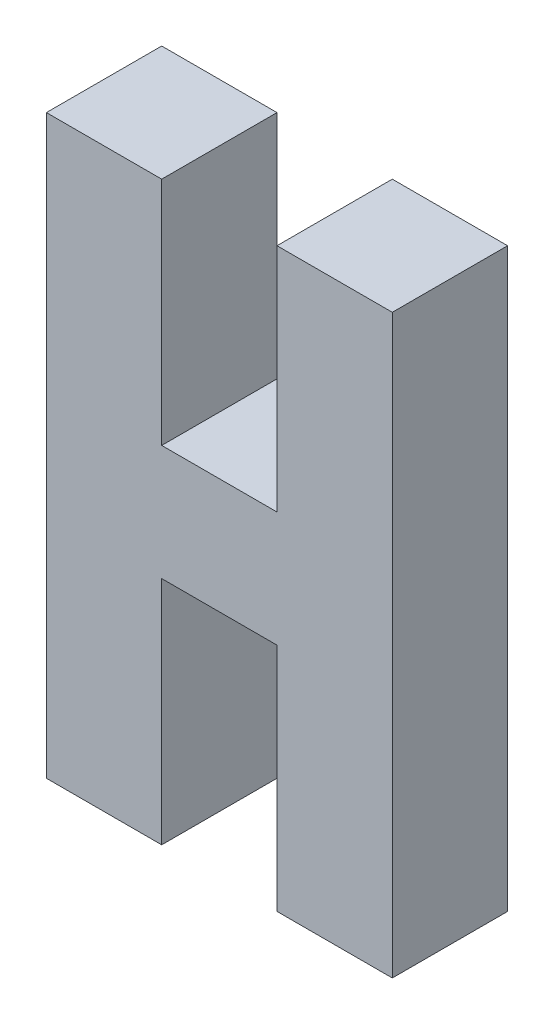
ISO-10303-21;
HEADER;
FILE_DESCRIPTION(('STEP AP214'),'2;1');
FILE_NAME('part.step','',(''),(''),'','','');
FILE_SCHEMA(('AUTOMOTIVE_DESIGN { 1 0 10303 214 1 1 1 1 }'));
ENDSEC;
DATA;
#1=APPLICATION_CONTEXT('core data for automotive mechanical design processes');
#2=APPLICATION_PROTOCOL_DEFINITION('international standard','automotive_design',2000,#1);
#3=PRODUCT_CONTEXT('',#1,'mechanical');
#4=PRODUCT('Part','Part','',(#3));
#5=PRODUCT_RELATED_PRODUCT_CATEGORY('part','',(#4));
#6=PRODUCT_DEFINITION_FORMATION('','',#4);
#7=PRODUCT_DEFINITION_CONTEXT('part definition',#1,'design');
#8=PRODUCT_DEFINITION('design','',#6,#7);
#9=PRODUCT_DEFINITION_SHAPE('','',#8);
#10=(LENGTH_UNIT() NAMED_UNIT(*) SI_UNIT(.MILLI.,.METRE.));
#11=(NAMED_UNIT(*) PLANE_ANGLE_UNIT() SI_UNIT($,.RADIAN.));
#12=(NAMED_UNIT(*) SI_UNIT($,.STERADIAN.) SOLID_ANGLE_UNIT());
#13=UNCERTAINTY_MEASURE_WITH_UNIT(LENGTH_MEASURE(1.E-05),#10,'distance_accuracy_value','');
#14=(GEOMETRIC_REPRESENTATION_CONTEXT(3) GLOBAL_UNCERTAINTY_ASSIGNED_CONTEXT((#13)) GLOBAL_UNIT_ASSIGNED_CONTEXT((#10,
#11,#12)) REPRESENTATION_CONTEXT('',''));
#15=CARTESIAN_POINT('',(0.,0.,0.));
#16=DIRECTION('',(0.,0.,1.));
#17=DIRECTION('',(1.,0.,0.));
#18=AXIS2_PLACEMENT_3D('',#15,#16,#17);
#19=CARTESIAN_POINT('',(0.,0.,10.));
#20=DIRECTION('',(1.,0.,0.));
#21=DIRECTION('',(0.,0.,-1.));
#22=AXIS2_PLACEMENT_3D('',#19,#20,#21);
#23=PLANE('',#22);
#24=DIRECTION('',(0.,-1.,0.));
#25=VECTOR('',#24,1.);
#26=CARTESIAN_POINT('',(0.,0.,0.));
#27=LINE('',#26,#25);
#28=CARTESIAN_POINT('',(0.,50.,0.));
#29=VERTEX_POINT('',#28);
#30=CARTESIAN_POINT('',(0.,0.,0.));
#31=VERTEX_POINT('',#30);
#32=EDGE_CURVE('E153',#29,#31,#27,.T.);
#33=ORIENTED_EDGE('',*,*,#32,.T.);
#34=DIRECTION('',(0.,0.,-1.));
#35=VECTOR('',#34,1.);
#36=CARTESIAN_POINT('',(0.,0.,10.));
#37=LINE('',#36,#35);
#38=CARTESIAN_POINT('',(0.,0.,10.));
#39=VERTEX_POINT('',#38);
#40=EDGE_CURVE('E11',#39,#31,#37,.T.);
#41=ORIENTED_EDGE('',*,*,#40,.F.);
#42=DIRECTION('',(0.,-1.,0.));
#43=VECTOR('',#42,1.);
#44=CARTESIAN_POINT('',(0.,0.,10.));
#45=LINE('',#44,#43);
#46=CARTESIAN_POINT('',(0.,50.,10.));
#47=VERTEX_POINT('',#46);
#48=EDGE_CURVE('E175',#47,#39,#45,.T.);
#49=ORIENTED_EDGE('',*,*,#48,.F.);
#50=DIRECTION('',(0.,0.,-1.));
#51=VECTOR('',#50,1.);
#52=CARTESIAN_POINT('',(0.,50.,10.));
#53=LINE('',#52,#51);
#54=EDGE_CURVE('E149',#47,#29,#53,.T.);
#55=ORIENTED_EDGE('',*,*,#54,.T.);
#56=EDGE_LOOP('',(#33,#41,#49,#55));
#57=FACE_BOUND('',#56,.T.);
#58=ADVANCED_FACE('F33',(#57),#23,.F.);
#59=CARTESIAN_POINT('',(0.,0.,10.));
#60=DIRECTION('',(0.,1.,0.));
#61=DIRECTION('',(0.,0.,1.));
#62=AXIS2_PLACEMENT_3D('',#59,#60,#61);
#63=PLANE('',#62);
#64=DIRECTION('',(1.,0.,0.));
#65=VECTOR('',#64,1.);
#66=CARTESIAN_POINT('',(0.,0.,0.));
#67=LINE('',#66,#65);
#68=CARTESIAN_POINT('',(10.,0.,0.));
#69=VERTEX_POINT('',#68);
#70=EDGE_CURVE('E156',#31,#69,#67,.T.);
#71=ORIENTED_EDGE('',*,*,#70,.T.);
#72=DIRECTION('',(0.,0.,-1.));
#73=VECTOR('',#72,1.);
#74=CARTESIAN_POINT('',(10.,0.,10.));
#75=LINE('',#74,#73);
#76=CARTESIAN_POINT('',(10.,0.,10.));
#77=VERTEX_POINT('',#76);
#78=EDGE_CURVE('E41',#77,#69,#75,.T.);
#79=ORIENTED_EDGE('',*,*,#78,.F.);
#80=DIRECTION('',(1.,0.,0.));
#81=VECTOR('',#80,1.);
#82=CARTESIAN_POINT('',(0.,0.,10.));
#83=LINE('',#82,#81);
#84=EDGE_CURVE('E104',#39,#77,#83,.T.);
#85=ORIENTED_EDGE('',*,*,#84,.F.);
#86=ORIENTED_EDGE('',*,*,#40,.T.);
#87=EDGE_LOOP('',(#71,#79,#85,#86));
#88=FACE_BOUND('',#87,.T.);
#89=ADVANCED_FACE('F253',(#88),#63,.F.);
#90=CARTESIAN_POINT('',(10.,0.,10.));
#91=DIRECTION('',(-1.,0.,0.));
#92=DIRECTION('',(0.,0.,1.));
#93=AXIS2_PLACEMENT_3D('',#90,#91,#92);
#94=PLANE('',#93);
#95=DIRECTION('',(0.,1.,0.));
#96=VECTOR('',#95,1.);
#97=CARTESIAN_POINT('',(10.,0.,0.));
#98=LINE('',#97,#96);
#99=CARTESIAN_POINT('',(10.,20.,0.));
#100=VERTEX_POINT('',#99);
#101=EDGE_CURVE('E158',#69,#100,#98,.T.);
#102=ORIENTED_EDGE('',*,*,#101,.T.);
#103=DIRECTION('',(0.,0.,-1.));
#104=VECTOR('',#103,1.);
#105=CARTESIAN_POINT('',(10.,20.,10.));
#106=LINE('',#105,#104);
#107=CARTESIAN_POINT('',(10.,20.,10.));
#108=VERTEX_POINT('',#107);
#109=EDGE_CURVE('E194',#108,#100,#106,.T.);
#110=ORIENTED_EDGE('',*,*,#109,.F.);
#111=DIRECTION('',(0.,1.,0.));
#112=VECTOR('',#111,1.);
#113=CARTESIAN_POINT('',(10.,0.,10.));
#114=LINE('',#113,#112);
#115=EDGE_CURVE('E202',#77,#108,#114,.T.);
#116=ORIENTED_EDGE('',*,*,#115,.F.);
#117=ORIENTED_EDGE('',*,*,#78,.T.);
#118=EDGE_LOOP('',(#102,#110,#116,#117));
#119=FACE_BOUND('',#118,.T.);
#120=ADVANCED_FACE('F200',(#119),#94,.F.);
#121=CARTESIAN_POINT('',(10.,20.,10.));
#122=DIRECTION('',(0.,1.,0.));
#123=DIRECTION('',(0.,0.,1.));
#124=AXIS2_PLACEMENT_3D('',#121,#122,#123);
#125=PLANE('',#124);
#126=DIRECTION('',(1.,0.,0.));
#127=VECTOR('',#126,1.);
#128=CARTESIAN_POINT('',(10.,20.,0.));
#129=LINE('',#128,#127);
#130=CARTESIAN_POINT('',(20.,20.,0.));
#131=VERTEX_POINT('',#130);
#132=EDGE_CURVE('E160',#100,#131,#129,.T.);
#133=ORIENTED_EDGE('',*,*,#132,.T.);
#134=DIRECTION('',(0.,0.,-1.));
#135=VECTOR('',#134,1.);
#136=CARTESIAN_POINT('',(20.,20.,10.));
#137=LINE('',#136,#135);
#138=CARTESIAN_POINT('',(20.,20.,10.));
#139=VERTEX_POINT('',#138);
#140=EDGE_CURVE('E191',#139,#131,#137,.T.);
#141=ORIENTED_EDGE('',*,*,#140,.F.);
#142=DIRECTION('',(1.,0.,0.));
#143=VECTOR('',#142,1.);
#144=CARTESIAN_POINT('',(10.,20.,10.));
#145=LINE('',#144,#143);
#146=EDGE_CURVE('E220',#108,#139,#145,.T.);
#147=ORIENTED_EDGE('',*,*,#146,.F.);
#148=ORIENTED_EDGE('',*,*,#109,.T.);
#149=EDGE_LOOP('',(#133,#141,#147,#148));
#150=FACE_BOUND('',#149,.T.);
#151=ADVANCED_FACE('F211',(#150),#125,.F.);
#152=CARTESIAN_POINT('',(20.,0.,10.));
#153=DIRECTION('',(1.,0.,0.));
#154=DIRECTION('',(0.,0.,-1.));
#155=AXIS2_PLACEMENT_3D('',#152,#153,#154);
#156=PLANE('',#155);
#157=DIRECTION('',(0.,-1.,0.));
#158=VECTOR('',#157,1.);
#159=CARTESIAN_POINT('',(20.,0.,0.));
#160=LINE('',#159,#158);
#161=CARTESIAN_POINT('',(20.,0.,0.));
#162=VERTEX_POINT('',#161);
#163=EDGE_CURVE('E162',#131,#162,#160,.T.);
#164=ORIENTED_EDGE('',*,*,#163,.T.);
#165=DIRECTION('',(0.,0.,-1.));
#166=VECTOR('',#165,1.);
#167=CARTESIAN_POINT('',(20.,0.,10.));
#168=LINE('',#167,#166);
#169=CARTESIAN_POINT('',(20.,0.,10.));
#170=VERTEX_POINT('',#169);
#171=EDGE_CURVE('E188',#170,#162,#168,.T.);
#172=ORIENTED_EDGE('',*,*,#171,.F.);
#173=DIRECTION('',(0.,-1.,0.));
#174=VECTOR('',#173,1.);
#175=CARTESIAN_POINT('',(20.,0.,10.));
#176=LINE('',#175,#174);
#177=EDGE_CURVE('E217',#139,#170,#176,.T.);
#178=ORIENTED_EDGE('',*,*,#177,.F.);
#179=ORIENTED_EDGE('',*,*,#140,.T.);
#180=EDGE_LOOP('',(#164,#172,#178,#179));
#181=FACE_BOUND('',#180,.T.);
#182=ADVANCED_FACE('F215',(#181),#156,.F.);
#183=CARTESIAN_POINT('',(20.,0.,10.));
#184=DIRECTION('',(0.,1.,0.));
#185=DIRECTION('',(0.,0.,1.));
#186=AXIS2_PLACEMENT_3D('',#183,#184,#185);
#187=PLANE('',#186);
#188=DIRECTION('',(1.,0.,0.));
#189=VECTOR('',#188,1.);
#190=CARTESIAN_POINT('',(20.,0.,0.));
#191=LINE('',#190,#189);
#192=CARTESIAN_POINT('',(30.,0.,0.));
#193=VERTEX_POINT('',#192);
#194=EDGE_CURVE('E164',#162,#193,#191,.T.);
#195=ORIENTED_EDGE('',*,*,#194,.T.);
#196=DIRECTION('',(0.,0.,-1.));
#197=VECTOR('',#196,1.);
#198=CARTESIAN_POINT('',(30.,0.,10.));
#199=LINE('',#198,#197);
#200=CARTESIAN_POINT('',(30.,0.,10.));
#201=VERTEX_POINT('',#200);
#202=EDGE_CURVE('E185',#201,#193,#199,.T.);
#203=ORIENTED_EDGE('',*,*,#202,.F.);
#204=DIRECTION('',(1.,0.,0.));
#205=VECTOR('',#204,1.);
#206=CARTESIAN_POINT('',(20.,0.,10.));
#207=LINE('',#206,#205);
#208=EDGE_CURVE('E219',#170,#201,#207,.T.);
#209=ORIENTED_EDGE('',*,*,#208,.F.);
#210=ORIENTED_EDGE('',*,*,#171,.T.);
#211=EDGE_LOOP('',(#195,#203,#209,#210));
#212=FACE_BOUND('',#211,.T.);
#213=ADVANCED_FACE('F266',(#212),#187,.F.);
#214=CARTESIAN_POINT('',(30.,0.,10.));
#215=DIRECTION('',(-1.,0.,0.));
#216=DIRECTION('',(0.,0.,1.));
#217=AXIS2_PLACEMENT_3D('',#214,#215,#216);
#218=PLANE('',#217);
#219=DIRECTION('',(0.,1.,0.));
#220=VECTOR('',#219,1.);
#221=CARTESIAN_POINT('',(30.,0.,0.));
#222=LINE('',#221,#220);
#223=CARTESIAN_POINT('',(30.,50.,0.));
#224=VERTEX_POINT('',#223);
#225=EDGE_CURVE('E166',#193,#224,#222,.T.);
#226=ORIENTED_EDGE('',*,*,#225,.T.);
#227=DIRECTION('',(0.,0.,-1.));
#228=VECTOR('',#227,1.);
#229=CARTESIAN_POINT('',(30.,50.,10.));
#230=LINE('',#229,#228);
#231=CARTESIAN_POINT('',(30.,50.,10.));
#232=VERTEX_POINT('',#231);
#233=EDGE_CURVE('E182',#232,#224,#230,.T.);
#234=ORIENTED_EDGE('',*,*,#233,.F.);
#235=DIRECTION('',(0.,1.,0.));
#236=VECTOR('',#235,1.);
#237=CARTESIAN_POINT('',(30.,0.,10.));
#238=LINE('',#237,#236);
#239=EDGE_CURVE('E222',#201,#232,#238,.T.);
#240=ORIENTED_EDGE('',*,*,#239,.F.);
#241=ORIENTED_EDGE('',*,*,#202,.T.);
#242=EDGE_LOOP('',(#226,#234,#240,#241));
#243=FACE_BOUND('',#242,.T.);
#244=ADVANCED_FACE('F269',(#243),#218,.F.);
#245=CARTESIAN_POINT('',(20.,50.,10.));
#246=DIRECTION('',(0.,-1.,0.));
#247=DIRECTION('',(0.,0.,-1.));
#248=AXIS2_PLACEMENT_3D('',#245,#246,#247);
#249=PLANE('',#248);
#250=DIRECTION('',(-1.,0.,0.));
#251=VECTOR('',#250,1.);
#252=CARTESIAN_POINT('',(20.,50.,0.));
#253=LINE('',#252,#251);
#254=CARTESIAN_POINT('',(20.,50.,0.));
#255=VERTEX_POINT('',#254);
#256=EDGE_CURVE('E168',#224,#255,#253,.T.);
#257=ORIENTED_EDGE('',*,*,#256,.T.);
#258=DIRECTION('',(0.,0.,-1.));
#259=VECTOR('',#258,1.);
#260=CARTESIAN_POINT('',(20.,50.,10.));
#261=LINE('',#260,#259);
#262=CARTESIAN_POINT('',(20.,50.,10.));
#263=VERTEX_POINT('',#262);
#264=EDGE_CURVE('E179',#263,#255,#261,.T.);
#265=ORIENTED_EDGE('',*,*,#264,.F.);
#266=DIRECTION('',(-1.,0.,0.));
#267=VECTOR('',#266,1.);
#268=CARTESIAN_POINT('',(20.,50.,10.));
#269=LINE('',#268,#267);
#270=EDGE_CURVE('E228',#232,#263,#269,.T.);
#271=ORIENTED_EDGE('',*,*,#270,.F.);
#272=ORIENTED_EDGE('',*,*,#233,.T.);
#273=EDGE_LOOP('',(#257,#265,#271,#272));
#274=FACE_BOUND('',#273,.T.);
#275=ADVANCED_FACE('F234',(#274),#249,.F.);
#276=CARTESIAN_POINT('',(20.,50.,10.));
#277=DIRECTION('',(1.,0.,0.));
#278=DIRECTION('',(0.,0.,-1.));
#279=AXIS2_PLACEMENT_3D('',#276,#277,#278);
#280=PLANE('',#279);
#281=DIRECTION('',(0.,-1.,0.));
#282=VECTOR('',#281,1.);
#283=CARTESIAN_POINT('',(20.,50.,0.));
#284=LINE('',#283,#282);
#285=CARTESIAN_POINT('',(20.,30.,0.));
#286=VERTEX_POINT('',#285);
#287=EDGE_CURVE('E170',#255,#286,#284,.T.);
#288=ORIENTED_EDGE('',*,*,#287,.T.);
#289=DIRECTION('',(0.,0.,-1.));
#290=VECTOR('',#289,1.);
#291=CARTESIAN_POINT('',(20.,30.,10.));
#292=LINE('',#291,#290);
#293=CARTESIAN_POINT('',(20.,30.,10.));
#294=VERTEX_POINT('',#293);
#295=EDGE_CURVE('E144',#294,#286,#292,.T.);
#296=ORIENTED_EDGE('',*,*,#295,.F.);
#297=DIRECTION('',(0.,-1.,0.));
#298=VECTOR('',#297,1.);
#299=CARTESIAN_POINT('',(20.,50.,10.));
#300=LINE('',#299,#298);
#301=EDGE_CURVE('E135',#263,#294,#300,.T.);
#302=ORIENTED_EDGE('',*,*,#301,.F.);
#303=ORIENTED_EDGE('',*,*,#264,.T.);
#304=EDGE_LOOP('',(#288,#296,#302,#303));
#305=FACE_BOUND('',#304,.T.);
#306=ADVANCED_FACE('F238',(#305),#280,.F.);
#307=CARTESIAN_POINT('',(9.99999999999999,30.,10.));
#308=DIRECTION('',(0.,-1.,0.));
#309=DIRECTION('',(0.,0.,-1.));
#310=AXIS2_PLACEMENT_3D('',#307,#308,#309);
#311=PLANE('',#310);
#312=DIRECTION('',(-1.,0.,0.));
#313=VECTOR('',#312,1.);
#314=CARTESIAN_POINT('',(9.99999999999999,30.,0.));
#315=LINE('',#314,#313);
#316=CARTESIAN_POINT('',(9.99999999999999,30.,0.));
#317=VERTEX_POINT('',#316);
#318=EDGE_CURVE('E143',#286,#317,#315,.T.);
#319=ORIENTED_EDGE('',*,*,#318,.T.);
#320=DIRECTION('',(0.,0.,-1.));
#321=VECTOR('',#320,1.);
#322=CARTESIAN_POINT('',(9.99999999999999,30.,10.));
#323=LINE('',#322,#321);
#324=CARTESIAN_POINT('',(9.99999999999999,30.,10.));
#325=VERTEX_POINT('',#324);
#326=EDGE_CURVE('E140',#325,#317,#323,.T.);
#327=ORIENTED_EDGE('',*,*,#326,.F.);
#328=DIRECTION('',(-1.,0.,0.));
#329=VECTOR('',#328,1.);
#330=CARTESIAN_POINT('',(9.99999999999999,30.,10.));
#331=LINE('',#330,#329);
#332=EDGE_CURVE('E129',#294,#325,#331,.T.);
#333=ORIENTED_EDGE('',*,*,#332,.F.);
#334=ORIENTED_EDGE('',*,*,#295,.T.);
#335=EDGE_LOOP('',(#319,#327,#333,#334));
#336=FACE_BOUND('',#335,.T.);
#337=ADVANCED_FACE('F141',(#336),#311,.F.);
#338=CARTESIAN_POINT('',(9.99999999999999,50.,10.));
#339=DIRECTION('',(-1.,0.,0.));
#340=DIRECTION('',(0.,-1.,0.));
#341=AXIS2_PLACEMENT_3D('',#338,#339,#340);
#342=PLANE('',#341);
#343=DIRECTION('',(0.,1.,0.));
#344=VECTOR('',#343,1.);
#345=CARTESIAN_POINT('',(9.99999999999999,50.,0.));
#346=LINE('',#345,#344);
#347=CARTESIAN_POINT('',(9.99999999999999,50.,0.));
#348=VERTEX_POINT('',#347);
#349=EDGE_CURVE('E90',#317,#348,#346,.T.);
#350=ORIENTED_EDGE('',*,*,#349,.T.);
#351=DIRECTION('',(0.,0.,-1.));
#352=VECTOR('',#351,1.);
#353=CARTESIAN_POINT('',(9.99999999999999,50.,10.));
#354=LINE('',#353,#352);
#355=CARTESIAN_POINT('',(9.99999999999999,50.,10.));
#356=VERTEX_POINT('',#355);
#357=EDGE_CURVE('E145',#356,#348,#354,.T.);
#358=ORIENTED_EDGE('',*,*,#357,.F.);
#359=DIRECTION('',(0.,1.,0.));
#360=VECTOR('',#359,1.);
#361=CARTESIAN_POINT('',(9.99999999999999,50.,10.));
#362=LINE('',#361,#360);
#363=EDGE_CURVE('E133',#325,#356,#362,.T.);
#364=ORIENTED_EDGE('',*,*,#363,.F.);
#365=ORIENTED_EDGE('',*,*,#326,.T.);
#366=EDGE_LOOP('',(#350,#358,#364,#365));
#367=FACE_BOUND('',#366,.T.);
#368=ADVANCED_FACE('F147',(#367),#342,.F.);
#369=CARTESIAN_POINT('',(0.,50.,10.));
#370=DIRECTION('',(0.,-1.,0.));
#371=DIRECTION('',(0.,0.,-1.));
#372=AXIS2_PLACEMENT_3D('',#369,#370,#371);
#373=PLANE('',#372);
#374=DIRECTION('',(-1.,0.,0.));
#375=VECTOR('',#374,1.);
#376=CARTESIAN_POINT('',(0.,50.,0.));
#377=LINE('',#376,#375);
#378=EDGE_CURVE('E96',#348,#29,#377,.T.);
#379=ORIENTED_EDGE('',*,*,#378,.T.);
#380=ORIENTED_EDGE('',*,*,#54,.F.);
#381=DIRECTION('',(-1.,0.,0.));
#382=VECTOR('',#381,1.);
#383=CARTESIAN_POINT('',(0.,50.,10.));
#384=LINE('',#383,#382);
#385=EDGE_CURVE('E49',#356,#47,#384,.T.);
#386=ORIENTED_EDGE('',*,*,#385,.F.);
#387=ORIENTED_EDGE('',*,*,#357,.T.);
#388=EDGE_LOOP('',(#379,#380,#386,#387));
#389=FACE_BOUND('',#388,.T.);
#390=ADVANCED_FACE('F242',(#389),#373,.F.);
#391=CARTESIAN_POINT('',(0.,0.,10.));
#392=DIRECTION('',(0.,0.,-1.));
#393=DIRECTION('',(-1.,0.,0.));
#394=AXIS2_PLACEMENT_3D('',#391,#392,#393);
#395=PLANE('',#394);
#396=ORIENTED_EDGE('',*,*,#48,.T.);
#397=ORIENTED_EDGE('',*,*,#84,.T.);
#398=ORIENTED_EDGE('',*,*,#115,.T.);
#399=ORIENTED_EDGE('',*,*,#146,.T.);
#400=ORIENTED_EDGE('',*,*,#177,.T.);
#401=ORIENTED_EDGE('',*,*,#208,.T.);
#402=ORIENTED_EDGE('',*,*,#239,.T.);
#403=ORIENTED_EDGE('',*,*,#270,.T.);
#404=ORIENTED_EDGE('',*,*,#301,.T.);
#405=ORIENTED_EDGE('',*,*,#332,.T.);
#406=ORIENTED_EDGE('',*,*,#363,.T.);
#407=ORIENTED_EDGE('',*,*,#385,.T.);
#408=EDGE_LOOP('',(#396,#397,#398,#399,#400,#401,#402,#403,#404,#405,#406,#407));
#409=FACE_BOUND('',#408,.T.);
#410=ADVANCED_FACE('F131',(#409),#395,.F.);
#411=CARTESIAN_POINT('',(0.,0.,0.));
#412=DIRECTION('',(0.,0.,-1.));
#413=DIRECTION('',(-1.,0.,0.));
#414=AXIS2_PLACEMENT_3D('',#411,#412,#413);
#415=PLANE('',#414);
#416=ORIENTED_EDGE('',*,*,#32,.F.);
#417=ORIENTED_EDGE('',*,*,#378,.F.);
#418=ORIENTED_EDGE('',*,*,#349,.F.);
#419=ORIENTED_EDGE('',*,*,#318,.F.);
#420=ORIENTED_EDGE('',*,*,#287,.F.);
#421=ORIENTED_EDGE('',*,*,#256,.F.);
#422=ORIENTED_EDGE('',*,*,#225,.F.);
#423=ORIENTED_EDGE('',*,*,#194,.F.);
#424=ORIENTED_EDGE('',*,*,#163,.F.);
#425=ORIENTED_EDGE('',*,*,#132,.F.);
#426=ORIENTED_EDGE('',*,*,#101,.F.);
#427=ORIENTED_EDGE('',*,*,#70,.F.);
#428=EDGE_LOOP('',(#416,#417,#418,#419,#420,#421,#422,#423,#424,#425,#426,#427));
#429=FACE_BOUND('',#428,.T.);
#430=ADVANCED_FACE('F206',(#429),#415,.T.);
#431=CLOSED_SHELL('',(#58,#89,#120,#151,#182,#213,#244,#275,#306,#337,#368,#390,#410,#430));
#432=MANIFOLD_SOLID_BREP('B2',#431);
#433=ADVANCED_BREP_SHAPE_REPRESENTATION('',(#18,#432),#14);
#434=SHAPE_DEFINITION_REPRESENTATION(#9,#433);
ENDSEC;
END-ISO-10303-21;
